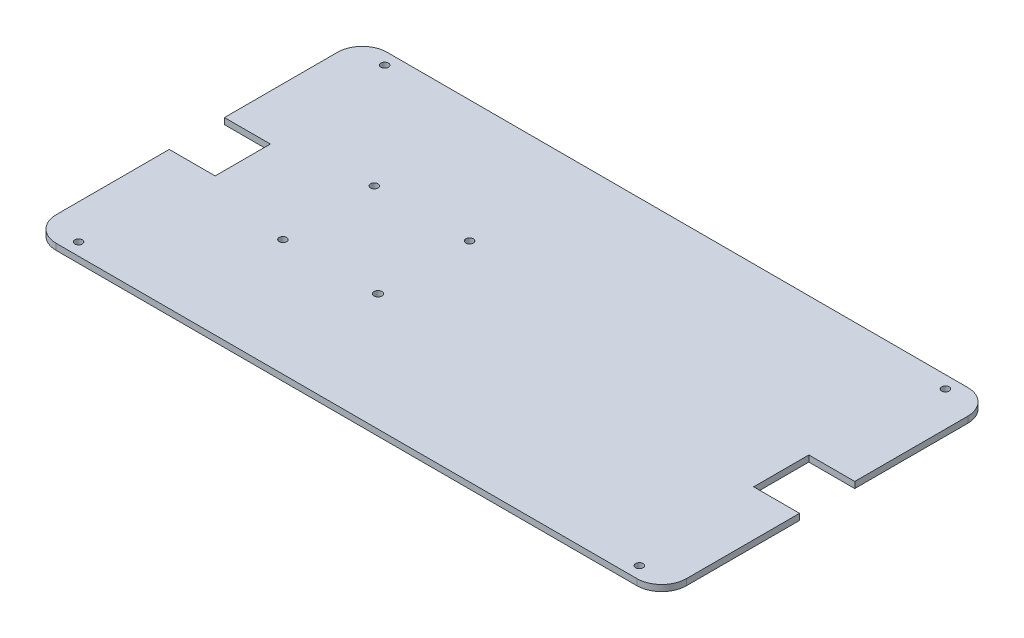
ISO-10303-21;
HEADER;
FILE_DESCRIPTION(('STEP AP214'),'2;1');
FILE_NAME('part.step','',(''),(''),'','','');
FILE_SCHEMA(('AUTOMOTIVE_DESIGN { 1 0 10303 214 1 1 1 1 }'));
ENDSEC;
DATA;
#1=APPLICATION_CONTEXT('core data for automotive mechanical design processes');
#2=APPLICATION_PROTOCOL_DEFINITION('international standard','automotive_design',2000,#1);
#3=PRODUCT_CONTEXT('',#1,'mechanical');
#4=PRODUCT('Part','Part','',(#3));
#5=PRODUCT_RELATED_PRODUCT_CATEGORY('part','',(#4));
#6=PRODUCT_DEFINITION_FORMATION('','',#4);
#7=PRODUCT_DEFINITION_CONTEXT('part definition',#1,'design');
#8=PRODUCT_DEFINITION('design','',#6,#7);
#9=PRODUCT_DEFINITION_SHAPE('','',#8);
#10=(LENGTH_UNIT() NAMED_UNIT(*) SI_UNIT(.MILLI.,.METRE.));
#11=(NAMED_UNIT(*) PLANE_ANGLE_UNIT() SI_UNIT($,.RADIAN.));
#12=(NAMED_UNIT(*) SI_UNIT($,.STERADIAN.) SOLID_ANGLE_UNIT());
#13=UNCERTAINTY_MEASURE_WITH_UNIT(LENGTH_MEASURE(1.E-05),#10,'distance_accuracy_value','');
#14=(GEOMETRIC_REPRESENTATION_CONTEXT(3) GLOBAL_UNCERTAINTY_ASSIGNED_CONTEXT((#13)) GLOBAL_UNIT_ASSIGNED_CONTEXT((#10,
#11,#12)) REPRESENTATION_CONTEXT('',''));
#15=CARTESIAN_POINT('',(0.,0.,0.));
#16=DIRECTION('',(0.,0.,1.));
#17=DIRECTION('',(1.,0.,0.));
#18=AXIS2_PLACEMENT_3D('',#15,#16,#17);
#19=CARTESIAN_POINT('',(127.,2.5,-66.675));
#20=DIRECTION('',(-1.,0.,0.));
#21=DIRECTION('',(0.,0.,1.));
#22=AXIS2_PLACEMENT_3D('',#19,#20,#21);
#23=PLANE('',#22);
#24=DIRECTION('',(0.,0.,-1.));
#25=VECTOR('',#24,1.);
#26=CARTESIAN_POINT('',(127.,2.5,-66.675));
#27=LINE('',#26,#25);
#28=CARTESIAN_POINT('',(127.,2.5,-11.125));
#29=VERTEX_POINT('',#28);
#30=CARTESIAN_POINT('',(127.,2.5,-56.675));
#31=VERTEX_POINT('',#30);
#32=EDGE_CURVE('E212',#29,#31,#27,.T.);
#33=ORIENTED_EDGE('',*,*,#32,.F.);
#34=DIRECTION('',(0.,1.,0.));
#35=VECTOR('',#34,1.);
#36=CARTESIAN_POINT('',(127.,-7.5,-11.125));
#37=LINE('',#36,#35);
#38=CARTESIAN_POINT('',(127.,0.,-11.125));
#39=VERTEX_POINT('',#38);
#40=EDGE_CURVE('E176',#39,#29,#37,.T.);
#41=ORIENTED_EDGE('',*,*,#40,.F.);
#42=DIRECTION('',(0.,0.,-1.));
#43=VECTOR('',#42,1.);
#44=CARTESIAN_POINT('',(127.,0.,-66.675));
#45=LINE('',#44,#43);
#46=CARTESIAN_POINT('',(127.,0.,-56.675));
#47=VERTEX_POINT('',#46);
#48=EDGE_CURVE('E209',#39,#47,#45,.T.);
#49=ORIENTED_EDGE('',*,*,#48,.T.);
#50=DIRECTION('',(0.,-1.,0.));
#51=VECTOR('',#50,1.);
#52=CARTESIAN_POINT('',(127.,2.5,-56.675));
#53=LINE('',#52,#51);
#54=EDGE_CURVE('E222',#47,#31,#53,.F.);
#55=ORIENTED_EDGE('',*,*,#54,.T.);
#56=EDGE_LOOP('',(#33,#41,#49,#55));
#57=FACE_BOUND('',#56,.T.);
#58=ADVANCED_FACE('F32',(#57),#23,.F.);
#59=CARTESIAN_POINT('',(-127.,2.5,-66.675));
#60=DIRECTION('',(1.,0.,0.));
#61=DIRECTION('',(0.,0.,-1.));
#62=AXIS2_PLACEMENT_3D('',#59,#60,#61);
#63=PLANE('',#62);
#64=DIRECTION('',(0.,0.,1.));
#65=VECTOR('',#64,1.);
#66=CARTESIAN_POINT('',(-127.,2.5,-66.675));
#67=LINE('',#66,#65);
#68=CARTESIAN_POINT('',(-127.,2.5,11.125));
#69=VERTEX_POINT('',#68);
#70=CARTESIAN_POINT('',(-127.,2.5,56.675));
#71=VERTEX_POINT('',#70);
#72=EDGE_CURVE('E215',#69,#71,#67,.T.);
#73=ORIENTED_EDGE('',*,*,#72,.F.);
#74=DIRECTION('',(0.,1.,0.));
#75=VECTOR('',#74,1.);
#76=CARTESIAN_POINT('',(-127.,-7.5,11.125));
#77=LINE('',#76,#75);
#78=CARTESIAN_POINT('',(-127.,0.,11.125));
#79=VERTEX_POINT('',#78);
#80=EDGE_CURVE('E190',#79,#69,#77,.T.);
#81=ORIENTED_EDGE('',*,*,#80,.F.);
#82=DIRECTION('',(0.,0.,1.));
#83=VECTOR('',#82,1.);
#84=CARTESIAN_POINT('',(-127.,0.,-66.675));
#85=LINE('',#84,#83);
#86=CARTESIAN_POINT('',(-127.,0.,56.675));
#87=VERTEX_POINT('',#86);
#88=EDGE_CURVE('E229',#79,#87,#85,.T.);
#89=ORIENTED_EDGE('',*,*,#88,.T.);
#90=DIRECTION('',(0.,-1.,0.));
#91=VECTOR('',#90,1.);
#92=CARTESIAN_POINT('',(-127.,2.5,56.675));
#93=LINE('',#92,#91);
#94=EDGE_CURVE('E269',#87,#71,#93,.F.);
#95=ORIENTED_EDGE('',*,*,#94,.T.);
#96=EDGE_LOOP('',(#73,#81,#89,#95));
#97=FACE_BOUND('',#96,.T.);
#98=ADVANCED_FACE('F380',(#97),#63,.F.);
#99=CARTESIAN_POINT('',(127.,0.,56.675));
#100=VERTEX_POINT('',#99);
#101=CARTESIAN_POINT('',(127.,0.,11.125));
#102=VERTEX_POINT('',#101);
#103=EDGE_CURVE('E223',#100,#102,#45,.T.);
#104=ORIENTED_EDGE('',*,*,#103,.T.);
#105=DIRECTION('',(0.,1.,0.));
#106=VECTOR('',#105,1.);
#107=CARTESIAN_POINT('',(127.,-7.5,11.125));
#108=LINE('',#107,#106);
#109=CARTESIAN_POINT('',(127.,2.5,11.125));
#110=VERTEX_POINT('',#109);
#111=EDGE_CURVE('E49',#102,#110,#108,.T.);
#112=ORIENTED_EDGE('',*,*,#111,.T.);
#113=CARTESIAN_POINT('',(127.,2.5,56.675));
#114=VERTEX_POINT('',#113);
#115=EDGE_CURVE('E169',#114,#110,#27,.T.);
#116=ORIENTED_EDGE('',*,*,#115,.F.);
#117=DIRECTION('',(0.,-1.,0.));
#118=VECTOR('',#117,1.);
#119=CARTESIAN_POINT('',(127.,2.5,56.675));
#120=LINE('',#119,#118);
#121=EDGE_CURVE('E238',#114,#100,#120,.T.);
#122=ORIENTED_EDGE('',*,*,#121,.T.);
#123=EDGE_LOOP('',(#104,#112,#116,#122));
#124=FACE_BOUND('',#123,.T.);
#125=ADVANCED_FACE('F382',(#124),#23,.F.);
#126=CARTESIAN_POINT('',(-127.,2.5,-66.675));
#127=DIRECTION('',(0.,0.,1.));
#128=DIRECTION('',(1.,0.,0.));
#129=AXIS2_PLACEMENT_3D('',#126,#127,#128);
#130=PLANE('',#129);
#131=DIRECTION('',(-1.,0.,0.));
#132=VECTOR('',#131,1.);
#133=CARTESIAN_POINT('',(-127.,2.5,-66.675));
#134=LINE('',#133,#132);
#135=CARTESIAN_POINT('',(117.,2.5,-66.675));
#136=VERTEX_POINT('',#135);
#137=CARTESIAN_POINT('',(-117.,2.5,-66.675));
#138=VERTEX_POINT('',#137);
#139=EDGE_CURVE('E211',#136,#138,#134,.T.);
#140=ORIENTED_EDGE('',*,*,#139,.F.);
#141=DIRECTION('',(0.,-1.,0.));
#142=VECTOR('',#141,1.);
#143=CARTESIAN_POINT('',(117.,2.5,-66.675));
#144=LINE('',#143,#142);
#145=CARTESIAN_POINT('',(117.,0.,-66.675));
#146=VERTEX_POINT('',#145);
#147=EDGE_CURVE('E266',#136,#146,#144,.T.);
#148=ORIENTED_EDGE('',*,*,#147,.T.);
#149=DIRECTION('',(-1.,0.,0.));
#150=VECTOR('',#149,1.);
#151=CARTESIAN_POINT('',(-127.,0.,-66.675));
#152=LINE('',#151,#150);
#153=CARTESIAN_POINT('',(-117.,0.,-66.675));
#154=VERTEX_POINT('',#153);
#155=EDGE_CURVE('E226',#146,#154,#152,.T.);
#156=ORIENTED_EDGE('',*,*,#155,.T.);
#157=DIRECTION('',(0.,-1.,0.));
#158=VECTOR('',#157,1.);
#159=CARTESIAN_POINT('',(-117.,2.5,-66.675));
#160=LINE('',#159,#158);
#161=EDGE_CURVE('E264',#154,#138,#160,.F.);
#162=ORIENTED_EDGE('',*,*,#161,.T.);
#163=EDGE_LOOP('',(#140,#148,#156,#162));
#164=FACE_BOUND('',#163,.T.);
#165=ADVANCED_FACE('F366',(#164),#130,.F.);
#166=CARTESIAN_POINT('',(-127.,0.,-56.675));
#167=VERTEX_POINT('',#166);
#168=CARTESIAN_POINT('',(-127.,0.,-11.125));
#169=VERTEX_POINT('',#168);
#170=EDGE_CURVE('E230',#167,#169,#85,.T.);
#171=ORIENTED_EDGE('',*,*,#170,.T.);
#172=DIRECTION('',(0.,1.,0.));
#173=VECTOR('',#172,1.);
#174=CARTESIAN_POINT('',(-127.,-7.5,-11.125));
#175=LINE('',#174,#173);
#176=CARTESIAN_POINT('',(-127.,2.5,-11.125));
#177=VERTEX_POINT('',#176);
#178=EDGE_CURVE('E57',#169,#177,#175,.T.);
#179=ORIENTED_EDGE('',*,*,#178,.T.);
#180=CARTESIAN_POINT('',(-127.,2.5,-56.675));
#181=VERTEX_POINT('',#180);
#182=EDGE_CURVE('E216',#181,#177,#67,.T.);
#183=ORIENTED_EDGE('',*,*,#182,.F.);
#184=DIRECTION('',(0.,-1.,0.));
#185=VECTOR('',#184,1.);
#186=CARTESIAN_POINT('',(-127.,2.5,-56.675));
#187=LINE('',#186,#185);
#188=EDGE_CURVE('E272',#181,#167,#187,.T.);
#189=ORIENTED_EDGE('',*,*,#188,.T.);
#190=EDGE_LOOP('',(#171,#179,#183,#189));
#191=FACE_BOUND('',#190,.T.);
#192=ADVANCED_FACE('F388',(#191),#63,.F.);
#193=CARTESIAN_POINT('',(-127.,2.5,66.675));
#194=DIRECTION('',(0.,0.,-1.));
#195=DIRECTION('',(-1.,0.,0.));
#196=AXIS2_PLACEMENT_3D('',#193,#194,#195);
#197=PLANE('',#196);
#198=DIRECTION('',(1.,0.,0.));
#199=VECTOR('',#198,1.);
#200=CARTESIAN_POINT('',(-127.,0.,66.675));
#201=LINE('',#200,#199);
#202=CARTESIAN_POINT('',(-117.,0.,66.675));
#203=VERTEX_POINT('',#202);
#204=CARTESIAN_POINT('',(117.,0.,66.675));
#205=VERTEX_POINT('',#204);
#206=EDGE_CURVE('E233',#203,#205,#201,.T.);
#207=ORIENTED_EDGE('',*,*,#206,.T.);
#208=DIRECTION('',(0.,-1.,0.));
#209=VECTOR('',#208,1.);
#210=CARTESIAN_POINT('',(117.,2.5,66.675));
#211=LINE('',#210,#209);
#212=CARTESIAN_POINT('',(117.,2.5,66.675));
#213=VERTEX_POINT('',#212);
#214=EDGE_CURVE('E254',#205,#213,#211,.F.);
#215=ORIENTED_EDGE('',*,*,#214,.T.);
#216=DIRECTION('',(1.,0.,0.));
#217=VECTOR('',#216,1.);
#218=CARTESIAN_POINT('',(-127.,2.5,66.675));
#219=LINE('',#218,#217);
#220=CARTESIAN_POINT('',(-117.,2.5,66.675));
#221=VERTEX_POINT('',#220);
#222=EDGE_CURVE('E219',#221,#213,#219,.T.);
#223=ORIENTED_EDGE('',*,*,#222,.F.);
#224=DIRECTION('',(0.,-1.,0.));
#225=VECTOR('',#224,1.);
#226=CARTESIAN_POINT('',(-117.,2.5,66.675));
#227=LINE('',#226,#225);
#228=EDGE_CURVE('E251',#221,#203,#227,.T.);
#229=ORIENTED_EDGE('',*,*,#228,.T.);
#230=EDGE_LOOP('',(#207,#215,#223,#229));
#231=FACE_BOUND('',#230,.T.);
#232=ADVANCED_FACE('F325',(#231),#197,.F.);
#233=CARTESIAN_POINT('',(0.,2.5,0.));
#234=DIRECTION('',(0.,1.,0.));
#235=DIRECTION('',(0.,0.,1.));
#236=AXIS2_PLACEMENT_3D('',#233,#234,#235);
#237=PLANE('',#236);
#238=CARTESIAN_POINT('',(-72.6212858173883,2.5,19.6877971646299));
#239=DIRECTION('',(0.,1.,0.));
#240=DIRECTION('',(0.,0.,1.));
#241=AXIS2_PLACEMENT_3D('',#238,#239,#240);
#242=CIRCLE('',#241,1.5);
#243=CARTESIAN_POINT('',(-72.6212858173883,2.5,21.1877971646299));
#244=VERTEX_POINT('',#243);
#245=EDGE_CURVE('E313',#244,#244,#242,.T.);
#246=ORIENTED_EDGE('',*,*,#245,.F.);
#247=EDGE_LOOP('',(#246));
#248=FACE_BOUND('',#247,.T.);
#249=CARTESIAN_POINT('',(-34.5480303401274,2.5,-17.4564356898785));
#250=DIRECTION('',(0.,1.,0.));
#251=DIRECTION('',(0.,0.,1.));
#252=AXIS2_PLACEMENT_3D('',#249,#250,#251);
#253=CIRCLE('',#252,1.5);
#254=CARTESIAN_POINT('',(-34.5480303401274,2.5,-15.9564356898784));
#255=VERTEX_POINT('',#254);
#256=EDGE_CURVE('E312',#255,#255,#253,.T.);
#257=ORIENTED_EDGE('',*,*,#256,.F.);
#258=EDGE_LOOP('',(#257));
#259=FACE_BOUND('',#258,.T.);
#260=CARTESIAN_POINT('',(-34.5659618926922,2.5,19.4492963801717));
#261=DIRECTION('',(0.,1.,0.));
#262=DIRECTION('',(0.,0.,1.));
#263=AXIS2_PLACEMENT_3D('',#260,#261,#262);
#264=CIRCLE('',#263,1.6);
#265=CARTESIAN_POINT('',(-34.5659618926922,2.5,21.0492963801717));
#266=VERTEX_POINT('',#265);
#267=EDGE_CURVE('E299',#266,#266,#264,.T.);
#268=ORIENTED_EDGE('',*,*,#267,.F.);
#269=EDGE_LOOP('',(#268));
#270=FACE_BOUND('',#269,.T.);
#271=CARTESIAN_POINT('',(-72.9711380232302,2.5,-17.470723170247));
#272=DIRECTION('',(0.,1.,0.));
#273=DIRECTION('',(0.,0.,1.));
#274=AXIS2_PLACEMENT_3D('',#271,#272,#273);
#275=CIRCLE('',#274,1.5);
#276=CARTESIAN_POINT('',(-72.9711380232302,2.5,-15.970723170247));
#277=VERTEX_POINT('',#276);
#278=EDGE_CURVE('E295',#277,#277,#275,.T.);
#279=ORIENTED_EDGE('',*,*,#278,.F.);
#280=EDGE_LOOP('',(#279));
#281=FACE_BOUND('',#280,.T.);
#282=DIRECTION('',(-1.,0.,0.));
#283=VECTOR('',#282,1.);
#284=CARTESIAN_POINT('',(108.5,2.5,-11.125));
#285=LINE('',#284,#283);
#286=CARTESIAN_POINT('',(108.5,2.5,-11.125));
#287=VERTEX_POINT('',#286);
#288=EDGE_CURVE('E153',#29,#287,#285,.T.);
#289=ORIENTED_EDGE('',*,*,#288,.F.);
#290=ORIENTED_EDGE('',*,*,#32,.T.);
#291=CARTESIAN_POINT('',(117.,2.5,-56.675));
#292=DIRECTION('',(0.,1.,0.));
#293=DIRECTION('',(0.,0.,1.));
#294=AXIS2_PLACEMENT_3D('',#291,#292,#293);
#295=CIRCLE('',#294,10.);
#296=EDGE_CURVE('E260',#31,#136,#295,.T.);
#297=ORIENTED_EDGE('',*,*,#296,.T.);
#298=ORIENTED_EDGE('',*,*,#139,.T.);
#299=CARTESIAN_POINT('',(-117.,2.5,-56.675));
#300=DIRECTION('',(0.,1.,0.));
#301=DIRECTION('',(0.,0.,1.));
#302=AXIS2_PLACEMENT_3D('',#299,#300,#301);
#303=CIRCLE('',#302,10.);
#304=EDGE_CURVE('E258',#138,#181,#303,.T.);
#305=ORIENTED_EDGE('',*,*,#304,.T.);
#306=ORIENTED_EDGE('',*,*,#182,.T.);
#307=DIRECTION('',(-1.,0.,0.));
#308=VECTOR('',#307,1.);
#309=CARTESIAN_POINT('',(-127.,2.5,-11.125));
#310=LINE('',#309,#308);
#311=CARTESIAN_POINT('',(-108.5,2.5,-11.125));
#312=VERTEX_POINT('',#311);
#313=EDGE_CURVE('E181',#312,#177,#310,.T.);
#314=ORIENTED_EDGE('',*,*,#313,.F.);
#315=DIRECTION('',(0.,0.,-1.));
#316=VECTOR('',#315,1.);
#317=CARTESIAN_POINT('',(-108.5,2.5,-11.125));
#318=LINE('',#317,#316);
#319=CARTESIAN_POINT('',(-108.5,2.5,11.125));
#320=VERTEX_POINT('',#319);
#321=EDGE_CURVE('E175',#320,#312,#318,.T.);
#322=ORIENTED_EDGE('',*,*,#321,.F.);
#323=DIRECTION('',(1.,0.,0.));
#324=VECTOR('',#323,1.);
#325=CARTESIAN_POINT('',(-127.,2.5,11.125));
#326=LINE('',#325,#324);
#327=EDGE_CURVE('E183',#69,#320,#326,.T.);
#328=ORIENTED_EDGE('',*,*,#327,.F.);
#329=ORIENTED_EDGE('',*,*,#72,.T.);
#330=CARTESIAN_POINT('',(-117.,2.5,56.675));
#331=DIRECTION('',(0.,1.,0.));
#332=DIRECTION('',(0.,0.,1.));
#333=AXIS2_PLACEMENT_3D('',#330,#331,#332);
#334=CIRCLE('',#333,10.);
#335=EDGE_CURVE('E256',#71,#221,#334,.T.);
#336=ORIENTED_EDGE('',*,*,#335,.T.);
#337=ORIENTED_EDGE('',*,*,#222,.T.);
#338=CARTESIAN_POINT('',(117.,2.5,56.675));
#339=DIRECTION('',(0.,1.,0.));
#340=DIRECTION('',(0.,0.,1.));
#341=AXIS2_PLACEMENT_3D('',#338,#339,#340);
#342=CIRCLE('',#341,10.);
#343=EDGE_CURVE('E262',#213,#114,#342,.T.);
#344=ORIENTED_EDGE('',*,*,#343,.T.);
#345=ORIENTED_EDGE('',*,*,#115,.T.);
#346=DIRECTION('',(1.,0.,0.));
#347=VECTOR('',#346,1.);
#348=CARTESIAN_POINT('',(108.5,2.5,11.125));
#349=LINE('',#348,#347);
#350=CARTESIAN_POINT('',(108.5,2.5,11.125));
#351=VERTEX_POINT('',#350);
#352=EDGE_CURVE('E149',#351,#110,#349,.T.);
#353=ORIENTED_EDGE('',*,*,#352,.F.);
#354=DIRECTION('',(0.,0.,1.));
#355=VECTOR('',#354,1.);
#356=CARTESIAN_POINT('',(108.5,2.5,-11.125));
#357=LINE('',#356,#355);
#358=EDGE_CURVE('E156',#287,#351,#357,.T.);
#359=ORIENTED_EDGE('',*,*,#358,.F.);
#360=EDGE_LOOP('',(#289,#290,#297,#298,#305,#306,#314,#322,#328,#329,#336,#337,#344,#345,#353,#359));
#361=FACE_BOUND('',#360,.T.);
#362=CARTESIAN_POINT('',(-113.,2.5,61.675));
#363=DIRECTION('',(0.,1.,0.));
#364=DIRECTION('',(0.,0.,1.));
#365=AXIS2_PLACEMENT_3D('',#362,#363,#364);
#366=CIRCLE('',#365,1.5);
#367=CARTESIAN_POINT('',(-113.,2.5,63.175));
#368=VERTEX_POINT('',#367);
#369=EDGE_CURVE('E202',#368,#368,#366,.F.);
#370=ORIENTED_EDGE('',*,*,#369,.T.);
#371=EDGE_LOOP('',(#370));
#372=FACE_BOUND('',#371,.T.);
#373=CARTESIAN_POINT('',(113.,2.5,-61.675));
#374=DIRECTION('',(0.,1.,0.));
#375=DIRECTION('',(0.,0.,1.));
#376=AXIS2_PLACEMENT_3D('',#373,#374,#375);
#377=CIRCLE('',#376,1.5);
#378=CARTESIAN_POINT('',(113.,2.5,-60.175));
#379=VERTEX_POINT('',#378);
#380=EDGE_CURVE('E198',#379,#379,#377,.F.);
#381=ORIENTED_EDGE('',*,*,#380,.T.);
#382=EDGE_LOOP('',(#381));
#383=FACE_BOUND('',#382,.T.);
#384=CARTESIAN_POINT('',(113.,2.5,61.675));
#385=DIRECTION('',(0.,1.,0.));
#386=DIRECTION('',(0.,0.,1.));
#387=AXIS2_PLACEMENT_3D('',#384,#385,#386);
#388=CIRCLE('',#387,1.5);
#389=CARTESIAN_POINT('',(113.,2.5,63.175));
#390=VERTEX_POINT('',#389);
#391=EDGE_CURVE('E194',#390,#390,#388,.F.);
#392=ORIENTED_EDGE('',*,*,#391,.T.);
#393=EDGE_LOOP('',(#392));
#394=FACE_BOUND('',#393,.T.);
#395=CARTESIAN_POINT('',(-113.,2.5,-61.675));
#396=DIRECTION('',(0.,1.,0.));
#397=DIRECTION('',(0.,0.,1.));
#398=AXIS2_PLACEMENT_3D('',#395,#396,#397);
#399=CIRCLE('',#398,1.5);
#400=CARTESIAN_POINT('',(-113.,2.5,-60.175));
#401=VERTEX_POINT('',#400);
#402=EDGE_CURVE('E206',#401,#401,#399,.F.);
#403=ORIENTED_EDGE('',*,*,#402,.T.);
#404=EDGE_LOOP('',(#403));
#405=FACE_BOUND('',#404,.T.);
#406=ADVANCED_FACE('F166',(#248,#259,#270,#281,#361,#372,#383,#394,#405),#237,.T.);
#407=CARTESIAN_POINT('',(0.,0.,0.));
#408=DIRECTION('',(0.,1.,0.));
#409=DIRECTION('',(0.,0.,1.));
#410=AXIS2_PLACEMENT_3D('',#407,#408,#409);
#411=PLANE('',#410);
#412=CARTESIAN_POINT('',(-72.6212858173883,0.,19.6877971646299));
#413=DIRECTION('',(0.,1.,0.));
#414=DIRECTION('',(0.,0.,1.));
#415=AXIS2_PLACEMENT_3D('',#412,#413,#414);
#416=CIRCLE('',#415,1.5);
#417=CARTESIAN_POINT('',(-72.6212858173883,0.,21.1877971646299));
#418=VERTEX_POINT('',#417);
#419=EDGE_CURVE('E36',#418,#418,#416,.T.);
#420=ORIENTED_EDGE('',*,*,#419,.T.);
#421=EDGE_LOOP('',(#420));
#422=FACE_BOUND('',#421,.T.);
#423=CARTESIAN_POINT('',(-34.5480303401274,0.,-17.4564356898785));
#424=DIRECTION('',(0.,1.,0.));
#425=DIRECTION('',(0.,0.,1.));
#426=AXIS2_PLACEMENT_3D('',#423,#424,#425);
#427=CIRCLE('',#426,1.5);
#428=CARTESIAN_POINT('',(-34.5480303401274,0.,-15.9564356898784));
#429=VERTEX_POINT('',#428);
#430=EDGE_CURVE('E298',#429,#429,#427,.T.);
#431=ORIENTED_EDGE('',*,*,#430,.T.);
#432=EDGE_LOOP('',(#431));
#433=FACE_BOUND('',#432,.T.);
#434=CARTESIAN_POINT('',(-34.5659618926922,0.,19.4492963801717));
#435=DIRECTION('',(0.,1.,0.));
#436=DIRECTION('',(0.,0.,1.));
#437=AXIS2_PLACEMENT_3D('',#434,#435,#436);
#438=CIRCLE('',#437,1.6);
#439=CARTESIAN_POINT('',(-34.5659618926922,0.,21.0492963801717));
#440=VERTEX_POINT('',#439);
#441=EDGE_CURVE('E296',#440,#440,#438,.T.);
#442=ORIENTED_EDGE('',*,*,#441,.T.);
#443=EDGE_LOOP('',(#442));
#444=FACE_BOUND('',#443,.T.);
#445=CARTESIAN_POINT('',(-72.9711380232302,0.,-17.470723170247));
#446=DIRECTION('',(0.,1.,0.));
#447=DIRECTION('',(0.,0.,1.));
#448=AXIS2_PLACEMENT_3D('',#445,#446,#447);
#449=CIRCLE('',#448,1.5);
#450=CARTESIAN_POINT('',(-72.9711380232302,0.,-15.970723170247));
#451=VERTEX_POINT('',#450);
#452=EDGE_CURVE('E163',#451,#451,#449,.T.);
#453=ORIENTED_EDGE('',*,*,#452,.T.);
#454=EDGE_LOOP('',(#453));
#455=FACE_BOUND('',#454,.T.);
#456=CARTESIAN_POINT('',(-113.,0.,61.675));
#457=DIRECTION('',(0.,1.,0.));
#458=DIRECTION('',(0.,0.,1.));
#459=AXIS2_PLACEMENT_3D('',#456,#457,#458);
#460=CIRCLE('',#459,1.5);
#461=CARTESIAN_POINT('',(-113.,0.,63.175));
#462=VERTEX_POINT('',#461);
#463=EDGE_CURVE('E201',#462,#462,#460,.F.);
#464=ORIENTED_EDGE('',*,*,#463,.F.);
#465=EDGE_LOOP('',(#464));
#466=FACE_BOUND('',#465,.T.);
#467=CARTESIAN_POINT('',(113.,0.,-61.675));
#468=DIRECTION('',(0.,1.,0.));
#469=DIRECTION('',(0.,0.,1.));
#470=AXIS2_PLACEMENT_3D('',#467,#468,#469);
#471=CIRCLE('',#470,1.5);
#472=CARTESIAN_POINT('',(113.,0.,-60.175));
#473=VERTEX_POINT('',#472);
#474=EDGE_CURVE('E197',#473,#473,#471,.F.);
#475=ORIENTED_EDGE('',*,*,#474,.F.);
#476=EDGE_LOOP('',(#475));
#477=FACE_BOUND('',#476,.T.);
#478=CARTESIAN_POINT('',(113.,0.,61.675));
#479=DIRECTION('',(0.,1.,0.));
#480=DIRECTION('',(0.,0.,1.));
#481=AXIS2_PLACEMENT_3D('',#478,#479,#480);
#482=CIRCLE('',#481,1.5);
#483=CARTESIAN_POINT('',(113.,0.,63.175));
#484=VERTEX_POINT('',#483);
#485=EDGE_CURVE('E189',#484,#484,#482,.F.);
#486=ORIENTED_EDGE('',*,*,#485,.F.);
#487=EDGE_LOOP('',(#486));
#488=FACE_BOUND('',#487,.T.);
#489=CARTESIAN_POINT('',(-113.,0.,-61.675));
#490=DIRECTION('',(0.,1.,0.));
#491=DIRECTION('',(0.,0.,1.));
#492=AXIS2_PLACEMENT_3D('',#489,#490,#491);
#493=CIRCLE('',#492,1.5);
#494=CARTESIAN_POINT('',(-113.,0.,-60.175));
#495=VERTEX_POINT('',#494);
#496=EDGE_CURVE('E205',#495,#495,#493,.F.);
#497=ORIENTED_EDGE('',*,*,#496,.F.);
#498=EDGE_LOOP('',(#497));
#499=FACE_BOUND('',#498,.T.);
#500=ORIENTED_EDGE('',*,*,#48,.F.);
#501=DIRECTION('',(-1.,0.,0.));
#502=VECTOR('',#501,1.);
#503=CARTESIAN_POINT('',(0.,0.,-11.125));
#504=LINE('',#503,#502);
#505=CARTESIAN_POINT('',(108.5,0.,-11.125));
#506=VERTEX_POINT('',#505);
#507=EDGE_CURVE('E11',#39,#506,#504,.T.);
#508=ORIENTED_EDGE('',*,*,#507,.T.);
#509=DIRECTION('',(0.,0.,1.));
#510=VECTOR('',#509,1.);
#511=CARTESIAN_POINT('',(108.5,0.,0.));
#512=LINE('',#511,#510);
#513=CARTESIAN_POINT('',(108.5,0.,11.125));
#514=VERTEX_POINT('',#513);
#515=EDGE_CURVE('E41',#506,#514,#512,.T.);
#516=ORIENTED_EDGE('',*,*,#515,.T.);
#517=DIRECTION('',(1.,0.,0.));
#518=VECTOR('',#517,1.);
#519=CARTESIAN_POINT('',(0.,0.,11.125));
#520=LINE('',#519,#518);
#521=EDGE_CURVE('E150',#514,#102,#520,.T.);
#522=ORIENTED_EDGE('',*,*,#521,.T.);
#523=ORIENTED_EDGE('',*,*,#103,.F.);
#524=CARTESIAN_POINT('',(117.,0.,56.675));
#525=DIRECTION('',(0.,1.,0.));
#526=DIRECTION('',(0.,0.,1.));
#527=AXIS2_PLACEMENT_3D('',#524,#525,#526);
#528=CIRCLE('',#527,10.);
#529=EDGE_CURVE('E249',#100,#205,#528,.F.);
#530=ORIENTED_EDGE('',*,*,#529,.T.);
#531=ORIENTED_EDGE('',*,*,#206,.F.);
#532=CARTESIAN_POINT('',(-117.,0.,56.675));
#533=DIRECTION('',(0.,1.,0.));
#534=DIRECTION('',(0.,0.,1.));
#535=AXIS2_PLACEMENT_3D('',#532,#533,#534);
#536=CIRCLE('',#535,10.);
#537=EDGE_CURVE('E241',#203,#87,#536,.F.);
#538=ORIENTED_EDGE('',*,*,#537,.T.);
#539=ORIENTED_EDGE('',*,*,#88,.F.);
#540=DIRECTION('',(1.,0.,0.));
#541=VECTOR('',#540,1.);
#542=CARTESIAN_POINT('',(0.,0.,11.125));
#543=LINE('',#542,#541);
#544=CARTESIAN_POINT('',(-108.5,0.,11.125));
#545=VERTEX_POINT('',#544);
#546=EDGE_CURVE('E288',#79,#545,#543,.T.);
#547=ORIENTED_EDGE('',*,*,#546,.T.);
#548=DIRECTION('',(0.,0.,-1.));
#549=VECTOR('',#548,1.);
#550=CARTESIAN_POINT('',(-108.5,0.,0.));
#551=LINE('',#550,#549);
#552=CARTESIAN_POINT('',(-108.5,0.,-11.125));
#553=VERTEX_POINT('',#552);
#554=EDGE_CURVE('E285',#545,#553,#551,.T.);
#555=ORIENTED_EDGE('',*,*,#554,.T.);
#556=DIRECTION('',(-1.,0.,0.));
#557=VECTOR('',#556,1.);
#558=CARTESIAN_POINT('',(0.,0.,-11.125));
#559=LINE('',#558,#557);
#560=EDGE_CURVE('E275',#553,#169,#559,.T.);
#561=ORIENTED_EDGE('',*,*,#560,.T.);
#562=ORIENTED_EDGE('',*,*,#170,.F.);
#563=CARTESIAN_POINT('',(-117.,0.,-56.675));
#564=DIRECTION('',(0.,1.,0.));
#565=DIRECTION('',(0.,0.,1.));
#566=AXIS2_PLACEMENT_3D('',#563,#564,#565);
#567=CIRCLE('',#566,10.);
#568=EDGE_CURVE('E244',#167,#154,#567,.F.);
#569=ORIENTED_EDGE('',*,*,#568,.T.);
#570=ORIENTED_EDGE('',*,*,#155,.F.);
#571=CARTESIAN_POINT('',(117.,0.,-56.675));
#572=DIRECTION('',(0.,1.,0.));
#573=DIRECTION('',(0.,0.,1.));
#574=AXIS2_PLACEMENT_3D('',#571,#572,#573);
#575=CIRCLE('',#574,10.);
#576=EDGE_CURVE('E246',#146,#47,#575,.F.);
#577=ORIENTED_EDGE('',*,*,#576,.T.);
#578=EDGE_LOOP('',(#500,#508,#516,#522,#523,#530,#531,#538,#539,#547,#555,#561,#562,#569,#570,#577));
#579=FACE_BOUND('',#578,.T.);
#580=ADVANCED_FACE('F324',(#422,#433,#444,#455,#466,#477,#488,#499,#579),#411,.F.);
#581=CARTESIAN_POINT('',(117.,2.5,56.675));
#582=DIRECTION('',(0.,-1.,0.));
#583=DIRECTION('',(0.,0.,-1.));
#584=AXIS2_PLACEMENT_3D('',#581,#582,#583);
#585=CYLINDRICAL_SURFACE('',#584,10.);
#586=ORIENTED_EDGE('',*,*,#343,.F.);
#587=ORIENTED_EDGE('',*,*,#214,.F.);
#588=ORIENTED_EDGE('',*,*,#529,.F.);
#589=ORIENTED_EDGE('',*,*,#121,.F.);
#590=EDGE_LOOP('',(#586,#587,#588,#589));
#591=FACE_BOUND('',#590,.T.);
#592=ADVANCED_FACE('F340',(#591),#585,.T.);
#593=CARTESIAN_POINT('',(117.,2.5,-56.675));
#594=DIRECTION('',(0.,-1.,0.));
#595=DIRECTION('',(0.,0.,-1.));
#596=AXIS2_PLACEMENT_3D('',#593,#594,#595);
#597=CYLINDRICAL_SURFACE('',#596,10.);
#598=ORIENTED_EDGE('',*,*,#296,.F.);
#599=ORIENTED_EDGE('',*,*,#54,.F.);
#600=ORIENTED_EDGE('',*,*,#576,.F.);
#601=ORIENTED_EDGE('',*,*,#147,.F.);
#602=EDGE_LOOP('',(#598,#599,#600,#601));
#603=FACE_BOUND('',#602,.T.);
#604=ADVANCED_FACE('F368',(#603),#597,.T.);
#605=CARTESIAN_POINT('',(-117.,2.5,-56.675));
#606=DIRECTION('',(0.,-1.,0.));
#607=DIRECTION('',(0.,0.,-1.));
#608=AXIS2_PLACEMENT_3D('',#605,#606,#607);
#609=CYLINDRICAL_SURFACE('',#608,10.);
#610=ORIENTED_EDGE('',*,*,#304,.F.);
#611=ORIENTED_EDGE('',*,*,#161,.F.);
#612=ORIENTED_EDGE('',*,*,#568,.F.);
#613=ORIENTED_EDGE('',*,*,#188,.F.);
#614=EDGE_LOOP('',(#610,#611,#612,#613));
#615=FACE_BOUND('',#614,.T.);
#616=ADVANCED_FACE('F370',(#615),#609,.T.);
#617=CARTESIAN_POINT('',(-117.,2.5,56.675));
#618=DIRECTION('',(0.,-1.,0.));
#619=DIRECTION('',(0.,0.,-1.));
#620=AXIS2_PLACEMENT_3D('',#617,#618,#619);
#621=CYLINDRICAL_SURFACE('',#620,10.);
#622=ORIENTED_EDGE('',*,*,#335,.F.);
#623=ORIENTED_EDGE('',*,*,#94,.F.);
#624=ORIENTED_EDGE('',*,*,#537,.F.);
#625=ORIENTED_EDGE('',*,*,#228,.F.);
#626=EDGE_LOOP('',(#622,#623,#624,#625));
#627=FACE_BOUND('',#626,.T.);
#628=ADVANCED_FACE('F34',(#627),#621,.T.);
#629=CARTESIAN_POINT('',(-113.,8.,-61.675));
#630=DIRECTION('',(0.,-1.,0.));
#631=DIRECTION('',(0.,0.,-1.));
#632=AXIS2_PLACEMENT_3D('',#629,#630,#631);
#633=CYLINDRICAL_SURFACE('',#632,1.5);
#634=ORIENTED_EDGE('',*,*,#402,.F.);
#635=EDGE_LOOP('',(#634));
#636=FACE_BOUND('',#635,.T.);
#637=ORIENTED_EDGE('',*,*,#496,.T.);
#638=EDGE_LOOP('',(#637));
#639=FACE_BOUND('',#638,.T.);
#640=ADVANCED_FACE('F428',(#636,#639),#633,.F.);
#641=CARTESIAN_POINT('',(113.,8.,61.675));
#642=DIRECTION('',(0.,-1.,0.));
#643=DIRECTION('',(0.,0.,-1.));
#644=AXIS2_PLACEMENT_3D('',#641,#642,#643);
#645=CYLINDRICAL_SURFACE('',#644,1.5);
#646=ORIENTED_EDGE('',*,*,#391,.F.);
#647=EDGE_LOOP('',(#646));
#648=FACE_BOUND('',#647,.T.);
#649=ORIENTED_EDGE('',*,*,#485,.T.);
#650=EDGE_LOOP('',(#649));
#651=FACE_BOUND('',#650,.T.);
#652=ADVANCED_FACE('F431',(#648,#651),#645,.F.);
#653=CARTESIAN_POINT('',(113.,8.,-61.675));
#654=DIRECTION('',(0.,-1.,0.));
#655=DIRECTION('',(0.,0.,-1.));
#656=AXIS2_PLACEMENT_3D('',#653,#654,#655);
#657=CYLINDRICAL_SURFACE('',#656,1.5);
#658=ORIENTED_EDGE('',*,*,#380,.F.);
#659=EDGE_LOOP('',(#658));
#660=FACE_BOUND('',#659,.T.);
#661=ORIENTED_EDGE('',*,*,#474,.T.);
#662=EDGE_LOOP('',(#661));
#663=FACE_BOUND('',#662,.T.);
#664=ADVANCED_FACE('F435',(#660,#663),#657,.F.);
#665=CARTESIAN_POINT('',(-113.,8.,61.675));
#666=DIRECTION('',(0.,-1.,0.));
#667=DIRECTION('',(0.,0.,-1.));
#668=AXIS2_PLACEMENT_3D('',#665,#666,#667);
#669=CYLINDRICAL_SURFACE('',#668,1.5);
#670=ORIENTED_EDGE('',*,*,#369,.F.);
#671=EDGE_LOOP('',(#670));
#672=FACE_BOUND('',#671,.T.);
#673=ORIENTED_EDGE('',*,*,#463,.T.);
#674=EDGE_LOOP('',(#673));
#675=FACE_BOUND('',#674,.T.);
#676=ADVANCED_FACE('F439',(#672,#675),#669,.F.);
#677=CARTESIAN_POINT('',(-108.5,-7.5,-11.125));
#678=DIRECTION('',(1.,0.,0.));
#679=DIRECTION('',(0.,0.,-1.));
#680=AXIS2_PLACEMENT_3D('',#677,#678,#679);
#681=PLANE('',#680);
#682=DIRECTION('',(0.,1.,0.));
#683=VECTOR('',#682,1.);
#684=CARTESIAN_POINT('',(-108.5,-7.5,11.125));
#685=LINE('',#684,#683);
#686=EDGE_CURVE('E187',#545,#320,#685,.T.);
#687=ORIENTED_EDGE('',*,*,#686,.T.);
#688=ORIENTED_EDGE('',*,*,#321,.T.);
#689=DIRECTION('',(0.,1.,0.));
#690=VECTOR('',#689,1.);
#691=CARTESIAN_POINT('',(-108.5,-7.5,-11.125));
#692=LINE('',#691,#690);
#693=EDGE_CURVE('E186',#553,#312,#692,.T.);
#694=ORIENTED_EDGE('',*,*,#693,.F.);
#695=ORIENTED_EDGE('',*,*,#554,.F.);
#696=EDGE_LOOP('',(#687,#688,#694,#695));
#697=FACE_BOUND('',#696,.T.);
#698=ADVANCED_FACE('F417',(#697),#681,.F.);
#699=CARTESIAN_POINT('',(-127.,-7.5,11.125));
#700=DIRECTION('',(0.,0.,1.));
#701=DIRECTION('',(1.,0.,0.));
#702=AXIS2_PLACEMENT_3D('',#699,#700,#701);
#703=PLANE('',#702);
#704=ORIENTED_EDGE('',*,*,#80,.T.);
#705=ORIENTED_EDGE('',*,*,#327,.T.);
#706=ORIENTED_EDGE('',*,*,#686,.F.);
#707=ORIENTED_EDGE('',*,*,#546,.F.);
#708=EDGE_LOOP('',(#704,#705,#706,#707));
#709=FACE_BOUND('',#708,.T.);
#710=ADVANCED_FACE('F411',(#709),#703,.F.);
#711=CARTESIAN_POINT('',(-127.,-7.5,-11.125));
#712=DIRECTION('',(0.,0.,-1.));
#713=DIRECTION('',(-1.,0.,0.));
#714=AXIS2_PLACEMENT_3D('',#711,#712,#713);
#715=PLANE('',#714);
#716=ORIENTED_EDGE('',*,*,#693,.T.);
#717=ORIENTED_EDGE('',*,*,#313,.T.);
#718=ORIENTED_EDGE('',*,*,#178,.F.);
#719=ORIENTED_EDGE('',*,*,#560,.F.);
#720=EDGE_LOOP('',(#716,#717,#718,#719));
#721=FACE_BOUND('',#720,.T.);
#722=ADVANCED_FACE('F446',(#721),#715,.F.);
#723=CARTESIAN_POINT('',(108.5,-7.5,-11.125));
#724=DIRECTION('',(-1.,0.,0.));
#725=DIRECTION('',(0.,0.,1.));
#726=AXIS2_PLACEMENT_3D('',#723,#724,#725);
#727=PLANE('',#726);
#728=DIRECTION('',(0.,1.,0.));
#729=VECTOR('',#728,1.);
#730=CARTESIAN_POINT('',(108.5,-7.5,-11.125));
#731=LINE('',#730,#729);
#732=EDGE_CURVE('E159',#506,#287,#731,.T.);
#733=ORIENTED_EDGE('',*,*,#732,.T.);
#734=ORIENTED_EDGE('',*,*,#358,.T.);
#735=DIRECTION('',(0.,1.,0.));
#736=VECTOR('',#735,1.);
#737=CARTESIAN_POINT('',(108.5,-7.5,11.125));
#738=LINE('',#737,#736);
#739=EDGE_CURVE('E145',#514,#351,#738,.T.);
#740=ORIENTED_EDGE('',*,*,#739,.F.);
#741=ORIENTED_EDGE('',*,*,#515,.F.);
#742=EDGE_LOOP('',(#733,#734,#740,#741));
#743=FACE_BOUND('',#742,.T.);
#744=ADVANCED_FACE('F157',(#743),#727,.F.);
#745=CARTESIAN_POINT('',(108.5,-7.5,-11.125));
#746=DIRECTION('',(0.,0.,-1.));
#747=DIRECTION('',(-1.,0.,0.));
#748=AXIS2_PLACEMENT_3D('',#745,#746,#747);
#749=PLANE('',#748);
#750=ORIENTED_EDGE('',*,*,#40,.T.);
#751=ORIENTED_EDGE('',*,*,#288,.T.);
#752=ORIENTED_EDGE('',*,*,#732,.F.);
#753=ORIENTED_EDGE('',*,*,#507,.F.);
#754=EDGE_LOOP('',(#750,#751,#752,#753));
#755=FACE_BOUND('',#754,.T.);
#756=ADVANCED_FACE('F360',(#755),#749,.F.);
#757=CARTESIAN_POINT('',(108.5,-7.5,11.125));
#758=DIRECTION('',(0.,0.,1.));
#759=DIRECTION('',(1.,0.,0.));
#760=AXIS2_PLACEMENT_3D('',#757,#758,#759);
#761=PLANE('',#760);
#762=ORIENTED_EDGE('',*,*,#739,.T.);
#763=ORIENTED_EDGE('',*,*,#352,.T.);
#764=ORIENTED_EDGE('',*,*,#111,.F.);
#765=ORIENTED_EDGE('',*,*,#521,.F.);
#766=EDGE_LOOP('',(#762,#763,#764,#765));
#767=FACE_BOUND('',#766,.T.);
#768=ADVANCED_FACE('F147',(#767),#761,.F.);
#769=CARTESIAN_POINT('',(-72.9711380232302,-7.5,-17.470723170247));
#770=DIRECTION('',(0.,1.,0.));
#771=DIRECTION('',(0.,0.,1.));
#772=AXIS2_PLACEMENT_3D('',#769,#770,#771);
#773=CYLINDRICAL_SURFACE('',#772,1.5);
#774=ORIENTED_EDGE('',*,*,#278,.T.);
#775=EDGE_LOOP('',(#774));
#776=FACE_BOUND('',#775,.T.);
#777=ORIENTED_EDGE('',*,*,#452,.F.);
#778=EDGE_LOOP('',(#777));
#779=FACE_BOUND('',#778,.T.);
#780=ADVANCED_FACE('F334',(#776,#779),#773,.F.);
#781=CARTESIAN_POINT('',(-34.5659618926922,-7.5,19.4492963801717));
#782=DIRECTION('',(0.,1.,0.));
#783=DIRECTION('',(0.,0.,1.));
#784=AXIS2_PLACEMENT_3D('',#781,#782,#783);
#785=CYLINDRICAL_SURFACE('',#784,1.6);
#786=ORIENTED_EDGE('',*,*,#267,.T.);
#787=EDGE_LOOP('',(#786));
#788=FACE_BOUND('',#787,.T.);
#789=ORIENTED_EDGE('',*,*,#441,.F.);
#790=EDGE_LOOP('',(#789));
#791=FACE_BOUND('',#790,.T.);
#792=ADVANCED_FACE('F331',(#788,#791),#785,.F.);
#793=CARTESIAN_POINT('',(-34.5480303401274,-7.5,-17.4564356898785));
#794=DIRECTION('',(0.,1.,0.));
#795=DIRECTION('',(0.,0.,1.));
#796=AXIS2_PLACEMENT_3D('',#793,#794,#795);
#797=CYLINDRICAL_SURFACE('',#796,1.5);
#798=ORIENTED_EDGE('',*,*,#256,.T.);
#799=EDGE_LOOP('',(#798));
#800=FACE_BOUND('',#799,.T.);
#801=ORIENTED_EDGE('',*,*,#430,.F.);
#802=EDGE_LOOP('',(#801));
#803=FACE_BOUND('',#802,.T.);
#804=ADVANCED_FACE('F319',(#800,#803),#797,.F.);
#805=CARTESIAN_POINT('',(-72.6212858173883,-7.5,19.6877971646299));
#806=DIRECTION('',(0.,1.,0.));
#807=DIRECTION('',(0.,0.,1.));
#808=AXIS2_PLACEMENT_3D('',#805,#806,#807);
#809=CYLINDRICAL_SURFACE('',#808,1.5);
#810=ORIENTED_EDGE('',*,*,#245,.T.);
#811=EDGE_LOOP('',(#810));
#812=FACE_BOUND('',#811,.T.);
#813=ORIENTED_EDGE('',*,*,#419,.F.);
#814=EDGE_LOOP('',(#813));
#815=FACE_BOUND('',#814,.T.);
#816=ADVANCED_FACE('F459',(#812,#815),#809,.F.);
#817=CLOSED_SHELL('',(#58,#98,#125,#165,#192,#232,#406,#580,#592,#604,#616,#628,#640,#652,#664,
#676,#698,#710,#722,#744,#756,#768,#780,#792,#804,#816));
#818=MANIFOLD_SOLID_BREP('B2',#817);
#819=ADVANCED_BREP_SHAPE_REPRESENTATION('',(#18,#818),#14);
#820=SHAPE_DEFINITION_REPRESENTATION(#9,#819);
ENDSEC;
END-ISO-10303-21;
